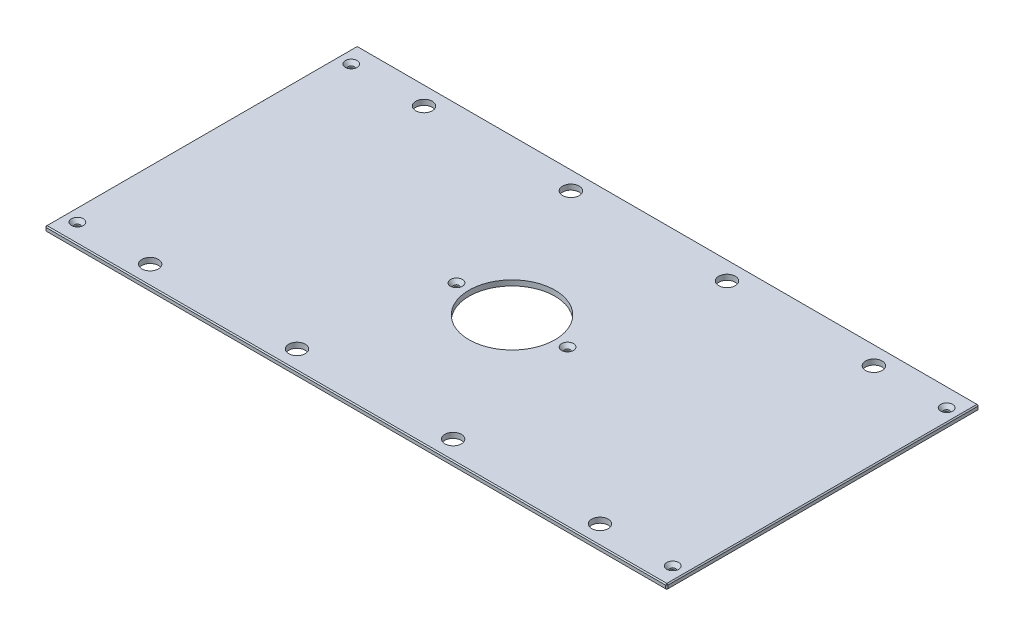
ISO-10303-21;
HEADER;
FILE_DESCRIPTION(('STEP AP214'),'2;1');
FILE_NAME('part.step','',(''),(''),'','','');
FILE_SCHEMA(('AUTOMOTIVE_DESIGN { 1 0 10303 214 1 1 1 1 }'));
ENDSEC;
DATA;
#1=APPLICATION_CONTEXT('core data for automotive mechanical design processes');
#2=APPLICATION_PROTOCOL_DEFINITION('international standard','automotive_design',2000,#1);
#3=PRODUCT_CONTEXT('',#1,'mechanical');
#4=PRODUCT('Part','Part','',(#3));
#5=PRODUCT_RELATED_PRODUCT_CATEGORY('part','',(#4));
#6=PRODUCT_DEFINITION_FORMATION('','',#4);
#7=PRODUCT_DEFINITION_CONTEXT('part definition',#1,'design');
#8=PRODUCT_DEFINITION('design','',#6,#7);
#9=PRODUCT_DEFINITION_SHAPE('','',#8);
#10=(LENGTH_UNIT() NAMED_UNIT(*) SI_UNIT(.MILLI.,.METRE.));
#11=(NAMED_UNIT(*) PLANE_ANGLE_UNIT() SI_UNIT($,.RADIAN.));
#12=(NAMED_UNIT(*) SI_UNIT($,.STERADIAN.) SOLID_ANGLE_UNIT());
#13=UNCERTAINTY_MEASURE_WITH_UNIT(LENGTH_MEASURE(1.E-05),#10,'distance_accuracy_value','');
#14=(GEOMETRIC_REPRESENTATION_CONTEXT(3) GLOBAL_UNCERTAINTY_ASSIGNED_CONTEXT((#13)) GLOBAL_UNIT_ASSIGNED_CONTEXT((#10,
#11,#12)) REPRESENTATION_CONTEXT('',''));
#15=CARTESIAN_POINT('',(0.,0.,0.));
#16=DIRECTION('',(0.,0.,1.));
#17=DIRECTION('',(1.,0.,0.));
#18=AXIS2_PLACEMENT_3D('',#15,#16,#17);
#19=CARTESIAN_POINT('',(-373.0625,6.35,-187.325));
#20=DIRECTION('',(1.,0.,0.));
#21=DIRECTION('',(0.,0.,-1.));
#22=AXIS2_PLACEMENT_3D('',#19,#20,#21);
#23=PLANE('',#22);
#24=DIRECTION('',(0.,0.,-1.));
#25=VECTOR('',#24,1.);
#26=CARTESIAN_POINT('',(-373.0625,5.0799999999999,-187.325));
#27=LINE('',#26,#25);
#28=CARTESIAN_POINT('',(-373.0625,5.0799999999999,186.055));
#29=VERTEX_POINT('',#28);
#30=CARTESIAN_POINT('',(-373.0625,5.0799999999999,-186.055));
#31=VERTEX_POINT('',#30);
#32=EDGE_CURVE('E135',#29,#31,#27,.T.);
#33=ORIENTED_EDGE('',*,*,#32,.T.);
#34=DIRECTION('',(0.,-1.,0.));
#35=VECTOR('',#34,1.);
#36=CARTESIAN_POINT('',(-373.0625,6.35,-186.055));
#37=LINE('',#36,#35);
#38=CARTESIAN_POINT('',(-373.0625,1.2700000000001,-186.055));
#39=VERTEX_POINT('',#38);
#40=EDGE_CURVE('E131',#31,#39,#37,.T.);
#41=ORIENTED_EDGE('',*,*,#40,.T.);
#42=DIRECTION('',(0.,0.,1.));
#43=VECTOR('',#42,1.);
#44=CARTESIAN_POINT('',(-373.0625,1.2700000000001,-187.325));
#45=LINE('',#44,#43);
#46=CARTESIAN_POINT('',(-373.0625,1.2700000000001,186.055));
#47=VERTEX_POINT('',#46);
#48=EDGE_CURVE('E126',#39,#47,#45,.T.);
#49=ORIENTED_EDGE('',*,*,#48,.T.);
#50=DIRECTION('',(0.,1.,0.));
#51=VECTOR('',#50,1.);
#52=CARTESIAN_POINT('',(-373.0625,6.35,186.055));
#53=LINE('',#52,#51);
#54=EDGE_CURVE('E128',#47,#29,#53,.T.);
#55=ORIENTED_EDGE('',*,*,#54,.T.);
#56=EDGE_LOOP('',(#33,#41,#49,#55));
#57=FACE_BOUND('',#56,.T.);
#58=ADVANCED_FACE('F35',(#57),#23,.F.);
#59=CARTESIAN_POINT('',(-373.0625,6.35,187.325));
#60=DIRECTION('',(0.,0.,-1.));
#61=DIRECTION('',(-1.,0.,0.));
#62=AXIS2_PLACEMENT_3D('',#59,#60,#61);
#63=PLANE('',#62);
#64=DIRECTION('',(1.,0.,0.));
#65=VECTOR('',#64,1.);
#66=CARTESIAN_POINT('',(-373.0625,1.2700000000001,187.325));
#67=LINE('',#66,#65);
#68=CARTESIAN_POINT('',(-371.7925,1.2700000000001,187.325));
#69=VERTEX_POINT('',#68);
#70=CARTESIAN_POINT('',(371.7925,1.2700000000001,187.325));
#71=VERTEX_POINT('',#70);
#72=EDGE_CURVE('E58',#69,#71,#67,.T.);
#73=ORIENTED_EDGE('',*,*,#72,.T.);
#74=DIRECTION('',(0.,1.,0.));
#75=VECTOR('',#74,1.);
#76=CARTESIAN_POINT('',(371.7925,6.35,187.325));
#77=LINE('',#76,#75);
#78=CARTESIAN_POINT('',(371.7925,5.0799999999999,187.325));
#79=VERTEX_POINT('',#78);
#80=EDGE_CURVE('E11',#71,#79,#77,.T.);
#81=ORIENTED_EDGE('',*,*,#80,.T.);
#82=DIRECTION('',(-1.,0.,0.));
#83=VECTOR('',#82,1.);
#84=CARTESIAN_POINT('',(-373.0625,5.0799999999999,187.325));
#85=LINE('',#84,#83);
#86=CARTESIAN_POINT('',(-371.7925,5.0799999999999,187.325));
#87=VERTEX_POINT('',#86);
#88=EDGE_CURVE('E44',#79,#87,#85,.T.);
#89=ORIENTED_EDGE('',*,*,#88,.T.);
#90=DIRECTION('',(0.,-1.,0.));
#91=VECTOR('',#90,1.);
#92=CARTESIAN_POINT('',(-371.7925,6.35,187.325));
#93=LINE('',#92,#91);
#94=EDGE_CURVE('E303',#87,#69,#93,.T.);
#95=ORIENTED_EDGE('',*,*,#94,.T.);
#96=EDGE_LOOP('',(#73,#81,#89,#95));
#97=FACE_BOUND('',#96,.T.);
#98=ADVANCED_FACE('F372',(#97),#63,.F.);
#99=CARTESIAN_POINT('',(373.0625,6.35,-187.325));
#100=DIRECTION('',(-1.,0.,0.));
#101=DIRECTION('',(0.,0.,1.));
#102=AXIS2_PLACEMENT_3D('',#99,#100,#101);
#103=PLANE('',#102);
#104=DIRECTION('',(0.,0.,-1.));
#105=VECTOR('',#104,1.);
#106=CARTESIAN_POINT('',(373.0625,1.2700000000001,-187.325));
#107=LINE('',#106,#105);
#108=CARTESIAN_POINT('',(373.0625,1.2700000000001,186.055));
#109=VERTEX_POINT('',#108);
#110=CARTESIAN_POINT('',(373.0625,1.2700000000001,-186.055));
#111=VERTEX_POINT('',#110);
#112=EDGE_CURVE('E298',#109,#111,#107,.T.);
#113=ORIENTED_EDGE('',*,*,#112,.T.);
#114=DIRECTION('',(0.,1.,0.));
#115=VECTOR('',#114,1.);
#116=CARTESIAN_POINT('',(373.0625,6.35,-186.055));
#117=LINE('',#116,#115);
#118=CARTESIAN_POINT('',(373.0625,5.0799999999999,-186.055));
#119=VERTEX_POINT('',#118);
#120=EDGE_CURVE('E300',#111,#119,#117,.T.);
#121=ORIENTED_EDGE('',*,*,#120,.T.);
#122=DIRECTION('',(0.,0.,1.));
#123=VECTOR('',#122,1.);
#124=CARTESIAN_POINT('',(373.0625,5.0799999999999,187.325));
#125=LINE('',#124,#123);
#126=CARTESIAN_POINT('',(373.0625,5.0799999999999,186.055));
#127=VERTEX_POINT('',#126);
#128=EDGE_CURVE('E296',#119,#127,#125,.T.);
#129=ORIENTED_EDGE('',*,*,#128,.T.);
#130=DIRECTION('',(0.,-1.,0.));
#131=VECTOR('',#130,1.);
#132=CARTESIAN_POINT('',(373.0625,6.35,186.055));
#133=LINE('',#132,#131);
#134=EDGE_CURVE('E294',#127,#109,#133,.T.);
#135=ORIENTED_EDGE('',*,*,#134,.T.);
#136=EDGE_LOOP('',(#113,#121,#129,#135));
#137=FACE_BOUND('',#136,.T.);
#138=ADVANCED_FACE('F359',(#137),#103,.F.);
#139=CARTESIAN_POINT('',(-373.0625,6.35,-187.325));
#140=DIRECTION('',(0.,0.,1.));
#141=DIRECTION('',(1.,0.,0.));
#142=AXIS2_PLACEMENT_3D('',#139,#140,#141);
#143=PLANE('',#142);
#144=DIRECTION('',(-1.,0.,0.));
#145=VECTOR('',#144,1.);
#146=CARTESIAN_POINT('',(-373.0625,1.2700000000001,-187.325));
#147=LINE('',#146,#145);
#148=CARTESIAN_POINT('',(371.7925,1.2700000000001,-187.325));
#149=VERTEX_POINT('',#148);
#150=CARTESIAN_POINT('',(-371.7925,1.2700000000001,-187.325));
#151=VERTEX_POINT('',#150);
#152=EDGE_CURVE('E270',#149,#151,#147,.T.);
#153=ORIENTED_EDGE('',*,*,#152,.T.);
#154=DIRECTION('',(0.,1.,0.));
#155=VECTOR('',#154,1.);
#156=CARTESIAN_POINT('',(-371.7925,6.35,-187.325));
#157=LINE('',#156,#155);
#158=CARTESIAN_POINT('',(-371.7925,5.0799999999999,-187.325));
#159=VERTEX_POINT('',#158);
#160=EDGE_CURVE('E274',#151,#159,#157,.T.);
#161=ORIENTED_EDGE('',*,*,#160,.T.);
#162=DIRECTION('',(1.,0.,0.));
#163=VECTOR('',#162,1.);
#164=CARTESIAN_POINT('',(373.0625,5.0799999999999,-187.325));
#165=LINE('',#164,#163);
#166=CARTESIAN_POINT('',(371.7925,5.0799999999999,-187.325));
#167=VERTEX_POINT('',#166);
#168=EDGE_CURVE('E272',#159,#167,#165,.T.);
#169=ORIENTED_EDGE('',*,*,#168,.T.);
#170=DIRECTION('',(0.,-1.,0.));
#171=VECTOR('',#170,1.);
#172=CARTESIAN_POINT('',(371.7925,6.35,-187.325));
#173=LINE('',#172,#171);
#174=EDGE_CURVE('E268',#167,#149,#173,.T.);
#175=ORIENTED_EDGE('',*,*,#174,.T.);
#176=EDGE_LOOP('',(#153,#161,#169,#175));
#177=FACE_BOUND('',#176,.T.);
#178=ADVANCED_FACE('F333',(#177),#143,.F.);
#179=CARTESIAN_POINT('',(0.,6.35,0.));
#180=DIRECTION('',(0.,1.,0.));
#181=DIRECTION('',(0.,0.,1.));
#182=AXIS2_PLACEMENT_3D('',#179,#180,#181);
#183=PLANE('',#182);
#184=CARTESIAN_POINT('',(357.1875,6.35,-164.30498));
#185=DIRECTION('',(0.,1.,0.));
#186=DIRECTION('',(0.,0.,1.));
#187=AXIS2_PLACEMENT_3D('',#184,#185,#186);
#188=CIRCLE('',#187,7.13740000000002);
#189=CARTESIAN_POINT('',(357.1875,6.35,-157.16758));
#190=VERTEX_POINT('',#189);
#191=EDGE_CURVE('E816',#190,#190,#188,.T.);
#192=ORIENTED_EDGE('',*,*,#191,.F.);
#193=EDGE_LOOP('',(#192));
#194=FACE_BOUND('',#193,.T.);
#195=CARTESIAN_POINT('',(357.1875,6.35,164.30498));
#196=DIRECTION('',(0.,1.,0.));
#197=DIRECTION('',(0.,0.,1.));
#198=AXIS2_PLACEMENT_3D('',#195,#196,#197);
#199=CIRCLE('',#198,7.13740000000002);
#200=CARTESIAN_POINT('',(357.1875,6.35,171.44238));
#201=VERTEX_POINT('',#200);
#202=EDGE_CURVE('E820',#201,#201,#199,.T.);
#203=ORIENTED_EDGE('',*,*,#202,.F.);
#204=EDGE_LOOP('',(#203));
#205=FACE_BOUND('',#204,.T.);
#206=CARTESIAN_POINT('',(-357.1875,6.35,164.30498));
#207=DIRECTION('',(0.,1.,0.));
#208=DIRECTION('',(0.,0.,1.));
#209=AXIS2_PLACEMENT_3D('',#206,#207,#208);
#210=CIRCLE('',#209,7.13740000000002);
#211=CARTESIAN_POINT('',(-357.1875,6.35,171.44238));
#212=VERTEX_POINT('',#211);
#213=EDGE_CURVE('E824',#212,#212,#210,.T.);
#214=ORIENTED_EDGE('',*,*,#213,.F.);
#215=EDGE_LOOP('',(#214));
#216=FACE_BOUND('',#215,.T.);
#217=CARTESIAN_POINT('',(-66.675,6.35,0.));
#218=DIRECTION('',(0.,1.,0.));
#219=DIRECTION('',(0.,0.,1.));
#220=AXIS2_PLACEMENT_3D('',#217,#218,#219);
#221=CIRCLE('',#220,7.1374);
#222=CARTESIAN_POINT('',(-66.675,6.35,7.1374));
#223=VERTEX_POINT('',#222);
#224=EDGE_CURVE('E828',#223,#223,#221,.T.);
#225=ORIENTED_EDGE('',*,*,#224,.F.);
#226=EDGE_LOOP('',(#225));
#227=FACE_BOUND('',#226,.T.);
#228=CARTESIAN_POINT('',(66.675,6.35,0.));
#229=DIRECTION('',(0.,1.,0.));
#230=DIRECTION('',(0.,0.,1.));
#231=AXIS2_PLACEMENT_3D('',#228,#229,#230);
#232=CIRCLE('',#231,7.1374);
#233=CARTESIAN_POINT('',(66.675,6.35,7.1374));
#234=VERTEX_POINT('',#233);
#235=EDGE_CURVE('E832',#234,#234,#232,.T.);
#236=ORIENTED_EDGE('',*,*,#235,.F.);
#237=EDGE_LOOP('',(#236));
#238=FACE_BOUND('',#237,.T.);
#239=CARTESIAN_POINT('',(-357.1875,6.35,-164.30498));
#240=DIRECTION('',(0.,1.,0.));
#241=DIRECTION('',(0.,0.,1.));
#242=AXIS2_PLACEMENT_3D('',#239,#240,#241);
#243=CIRCLE('',#242,7.13740000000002);
#244=CARTESIAN_POINT('',(-357.1875,6.35,-157.16758));
#245=VERTEX_POINT('',#244);
#246=EDGE_CURVE('E835',#245,#245,#243,.T.);
#247=ORIENTED_EDGE('',*,*,#246,.F.);
#248=EDGE_LOOP('',(#247));
#249=FACE_BOUND('',#248,.T.);
#250=DIRECTION('',(0.,0.,-1.));
#251=VECTOR('',#250,1.);
#252=CARTESIAN_POINT('',(371.7925,6.35,-187.325));
#253=LINE('',#252,#251);
#254=CARTESIAN_POINT('',(371.7925,6.35,186.055));
#255=VERTEX_POINT('',#254);
#256=CARTESIAN_POINT('',(371.7925,6.35,-186.055));
#257=VERTEX_POINT('',#256);
#258=EDGE_CURVE('E281',#255,#257,#253,.T.);
#259=ORIENTED_EDGE('',*,*,#258,.T.);
#260=DIRECTION('',(-1.,0.,0.));
#261=VECTOR('',#260,1.);
#262=CARTESIAN_POINT('',(-373.0625,6.35,-186.055));
#263=LINE('',#262,#261);
#264=CARTESIAN_POINT('',(-371.7925,6.35,-186.055));
#265=VERTEX_POINT('',#264);
#266=EDGE_CURVE('E283',#257,#265,#263,.T.);
#267=ORIENTED_EDGE('',*,*,#266,.T.);
#268=DIRECTION('',(0.,0.,1.));
#269=VECTOR('',#268,1.);
#270=CARTESIAN_POINT('',(-371.7925,6.35,187.325));
#271=LINE('',#270,#269);
#272=CARTESIAN_POINT('',(-371.7925,6.35,186.055));
#273=VERTEX_POINT('',#272);
#274=EDGE_CURVE('E279',#265,#273,#271,.T.);
#275=ORIENTED_EDGE('',*,*,#274,.T.);
#276=DIRECTION('',(1.,0.,0.));
#277=VECTOR('',#276,1.);
#278=CARTESIAN_POINT('',(373.0625,6.35,186.055));
#279=LINE('',#278,#277);
#280=EDGE_CURVE('E277',#273,#255,#279,.T.);
#281=ORIENTED_EDGE('',*,*,#280,.T.);
#282=EDGE_LOOP('',(#259,#267,#275,#281));
#283=FACE_BOUND('',#282,.T.);
#284=CARTESIAN_POINT('',(269.875,6.35,-164.30498));
#285=DIRECTION('',(0.,1.,0.));
#286=DIRECTION('',(0.,0.,1.));
#287=AXIS2_PLACEMENT_3D('',#284,#285,#286);
#288=CIRCLE('',#287,9.92187500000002);
#289=CARTESIAN_POINT('',(269.875,6.35,-154.383105));
#290=VERTEX_POINT('',#289);
#291=EDGE_CURVE('E204',#290,#290,#288,.T.);
#292=ORIENTED_EDGE('',*,*,#291,.F.);
#293=EDGE_LOOP('',(#292));
#294=FACE_BOUND('',#293,.T.);
#295=CARTESIAN_POINT('',(-269.875,6.35,-164.30498));
#296=DIRECTION('',(0.,1.,0.));
#297=DIRECTION('',(0.,0.,1.));
#298=AXIS2_PLACEMENT_3D('',#295,#296,#297);
#299=CIRCLE('',#298,9.92187500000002);
#300=CARTESIAN_POINT('',(-269.875,6.35,-154.383105));
#301=VERTEX_POINT('',#300);
#302=EDGE_CURVE('E214',#301,#301,#299,.T.);
#303=ORIENTED_EDGE('',*,*,#302,.F.);
#304=EDGE_LOOP('',(#303));
#305=FACE_BOUND('',#304,.T.);
#306=CARTESIAN_POINT('',(269.875,6.35,164.30498));
#307=DIRECTION('',(0.,1.,0.));
#308=DIRECTION('',(0.,0.,1.));
#309=AXIS2_PLACEMENT_3D('',#306,#307,#308);
#310=CIRCLE('',#309,9.92187500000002);
#311=CARTESIAN_POINT('',(269.875,6.35,174.226855));
#312=VERTEX_POINT('',#311);
#313=EDGE_CURVE('E225',#312,#312,#310,.T.);
#314=ORIENTED_EDGE('',*,*,#313,.F.);
#315=EDGE_LOOP('',(#314));
#316=FACE_BOUND('',#315,.T.);
#317=CARTESIAN_POINT('',(-269.875,6.35,164.30498));
#318=DIRECTION('',(0.,1.,0.));
#319=DIRECTION('',(0.,0.,1.));
#320=AXIS2_PLACEMENT_3D('',#317,#318,#319);
#321=CIRCLE('',#320,9.92187500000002);
#322=CARTESIAN_POINT('',(-269.875,6.35,174.226855));
#323=VERTEX_POINT('',#322);
#324=EDGE_CURVE('E231',#323,#323,#321,.T.);
#325=ORIENTED_EDGE('',*,*,#324,.F.);
#326=EDGE_LOOP('',(#325));
#327=FACE_BOUND('',#326,.T.);
#328=CARTESIAN_POINT('',(-93.6625,6.35,-164.30498));
#329=DIRECTION('',(0.,1.,0.));
#330=DIRECTION('',(0.,0.,1.));
#331=AXIS2_PLACEMENT_3D('',#328,#329,#330);
#332=CIRCLE('',#331,9.921875);
#333=CARTESIAN_POINT('',(-93.6625,6.35,-154.383105));
#334=VERTEX_POINT('',#333);
#335=EDGE_CURVE('E237',#334,#334,#332,.T.);
#336=ORIENTED_EDGE('',*,*,#335,.F.);
#337=EDGE_LOOP('',(#336));
#338=FACE_BOUND('',#337,.T.);
#339=CARTESIAN_POINT('',(93.6625,6.35,-164.30498));
#340=DIRECTION('',(0.,1.,0.));
#341=DIRECTION('',(0.,0.,1.));
#342=AXIS2_PLACEMENT_3D('',#339,#340,#341);
#343=CIRCLE('',#342,9.921875);
#344=CARTESIAN_POINT('',(93.6625,6.35,-154.383105));
#345=VERTEX_POINT('',#344);
#346=EDGE_CURVE('E243',#345,#345,#343,.T.);
#347=ORIENTED_EDGE('',*,*,#346,.F.);
#348=EDGE_LOOP('',(#347));
#349=FACE_BOUND('',#348,.T.);
#350=CARTESIAN_POINT('',(93.6625,6.35,164.30498));
#351=DIRECTION('',(0.,1.,0.));
#352=DIRECTION('',(0.,0.,1.));
#353=AXIS2_PLACEMENT_3D('',#350,#351,#352);
#354=CIRCLE('',#353,9.921875);
#355=CARTESIAN_POINT('',(93.6625,6.35,174.226855));
#356=VERTEX_POINT('',#355);
#357=EDGE_CURVE('E249',#356,#356,#354,.T.);
#358=ORIENTED_EDGE('',*,*,#357,.F.);
#359=EDGE_LOOP('',(#358));
#360=FACE_BOUND('',#359,.T.);
#361=CARTESIAN_POINT('',(-93.6625,6.35,164.30498));
#362=DIRECTION('',(0.,1.,0.));
#363=DIRECTION('',(0.,0.,1.));
#364=AXIS2_PLACEMENT_3D('',#361,#362,#363);
#365=CIRCLE('',#364,9.921875);
#366=CARTESIAN_POINT('',(-93.6625,6.35,174.226855));
#367=VERTEX_POINT('',#366);
#368=EDGE_CURVE('E255',#367,#367,#365,.T.);
#369=ORIENTED_EDGE('',*,*,#368,.F.);
#370=EDGE_LOOP('',(#369));
#371=FACE_BOUND('',#370,.T.);
#372=CARTESIAN_POINT('',(0.,6.35,0.));
#373=DIRECTION('',(0.,1.,0.));
#374=DIRECTION('',(0.,0.,1.));
#375=AXIS2_PLACEMENT_3D('',#372,#373,#374);
#376=CIRCLE('',#375,51.562);
#377=CARTESIAN_POINT('',(0.,6.35,51.562));
#378=VERTEX_POINT('',#377);
#379=EDGE_CURVE('E261',#378,#378,#376,.T.);
#380=ORIENTED_EDGE('',*,*,#379,.F.);
#381=EDGE_LOOP('',(#380));
#382=FACE_BOUND('',#381,.T.);
#383=ADVANCED_FACE('F381',(#194,#205,#216,#227,#238,#249,#283,#294,#305,#316,#327,#338,#349,
#360,#371,#382),#183,.T.);
#384=CARTESIAN_POINT('',(0.,0.,0.));
#385=DIRECTION('',(0.,1.,0.));
#386=DIRECTION('',(0.,0.,1.));
#387=AXIS2_PLACEMENT_3D('',#384,#385,#386);
#388=PLANE('',#387);
#389=CARTESIAN_POINT('',(357.1875,0.,-164.30498));
#390=DIRECTION('',(0.,1.,0.));
#391=DIRECTION('',(0.,0.,1.));
#392=AXIS2_PLACEMENT_3D('',#389,#390,#391);
#393=CIRCLE('',#392,3.3782);
#394=CARTESIAN_POINT('',(357.1875,0.,-160.92678));
#395=VERTEX_POINT('',#394);
#396=EDGE_CURVE('E869',#395,#395,#393,.T.);
#397=ORIENTED_EDGE('',*,*,#396,.T.);
#398=EDGE_LOOP('',(#397));
#399=FACE_BOUND('',#398,.T.);
#400=CARTESIAN_POINT('',(357.1875,0.,164.30498));
#401=DIRECTION('',(0.,1.,0.));
#402=DIRECTION('',(0.,0.,1.));
#403=AXIS2_PLACEMENT_3D('',#400,#401,#402);
#404=CIRCLE('',#403,3.3782);
#405=CARTESIAN_POINT('',(357.1875,0.,167.68318));
#406=VERTEX_POINT('',#405);
#407=EDGE_CURVE('E862',#406,#406,#404,.T.);
#408=ORIENTED_EDGE('',*,*,#407,.T.);
#409=EDGE_LOOP('',(#408));
#410=FACE_BOUND('',#409,.T.);
#411=CARTESIAN_POINT('',(-357.1875,0.,164.30498));
#412=DIRECTION('',(0.,1.,0.));
#413=DIRECTION('',(0.,0.,1.));
#414=AXIS2_PLACEMENT_3D('',#411,#412,#413);
#415=CIRCLE('',#414,3.3782);
#416=CARTESIAN_POINT('',(-357.1875,0.,167.68318));
#417=VERTEX_POINT('',#416);
#418=EDGE_CURVE('E855',#417,#417,#415,.T.);
#419=ORIENTED_EDGE('',*,*,#418,.T.);
#420=EDGE_LOOP('',(#419));
#421=FACE_BOUND('',#420,.T.);
#422=CARTESIAN_POINT('',(-66.675,0.,0.));
#423=DIRECTION('',(0.,1.,0.));
#424=DIRECTION('',(0.,0.,1.));
#425=AXIS2_PLACEMENT_3D('',#422,#423,#424);
#426=CIRCLE('',#425,3.3782);
#427=CARTESIAN_POINT('',(-66.675,0.,3.3782));
#428=VERTEX_POINT('',#427);
#429=EDGE_CURVE('E848',#428,#428,#426,.T.);
#430=ORIENTED_EDGE('',*,*,#429,.T.);
#431=EDGE_LOOP('',(#430));
#432=FACE_BOUND('',#431,.T.);
#433=CARTESIAN_POINT('',(66.675,0.,0.));
#434=DIRECTION('',(0.,1.,0.));
#435=DIRECTION('',(0.,0.,1.));
#436=AXIS2_PLACEMENT_3D('',#433,#434,#435);
#437=CIRCLE('',#436,3.3782);
#438=CARTESIAN_POINT('',(66.675,0.,3.3782));
#439=VERTEX_POINT('',#438);
#440=EDGE_CURVE('E838',#439,#439,#437,.T.);
#441=ORIENTED_EDGE('',*,*,#440,.T.);
#442=EDGE_LOOP('',(#441));
#443=FACE_BOUND('',#442,.T.);
#444=CARTESIAN_POINT('',(-357.1875,0.,-164.30498));
#445=DIRECTION('',(0.,1.,0.));
#446=DIRECTION('',(0.,0.,1.));
#447=AXIS2_PLACEMENT_3D('',#444,#445,#446);
#448=CIRCLE('',#447,3.3782);
#449=CARTESIAN_POINT('',(-357.1875,0.,-160.92678));
#450=VERTEX_POINT('',#449);
#451=EDGE_CURVE('E217',#450,#450,#448,.T.);
#452=ORIENTED_EDGE('',*,*,#451,.T.);
#453=EDGE_LOOP('',(#452));
#454=FACE_BOUND('',#453,.T.);
#455=DIRECTION('',(0.,0.,-1.));
#456=VECTOR('',#455,1.);
#457=CARTESIAN_POINT('',(-371.7925,0.,0.));
#458=LINE('',#457,#456);
#459=CARTESIAN_POINT('',(-371.7925,0.,186.055));
#460=VERTEX_POINT('',#459);
#461=CARTESIAN_POINT('',(-371.7925,0.,-186.055));
#462=VERTEX_POINT('',#461);
#463=EDGE_CURVE('E158',#460,#462,#458,.T.);
#464=ORIENTED_EDGE('',*,*,#463,.T.);
#465=DIRECTION('',(1.,0.,0.));
#466=VECTOR('',#465,1.);
#467=CARTESIAN_POINT('',(0.,0.,-186.055));
#468=LINE('',#467,#466);
#469=CARTESIAN_POINT('',(371.7925,0.,-186.055));
#470=VERTEX_POINT('',#469);
#471=EDGE_CURVE('E291',#462,#470,#468,.T.);
#472=ORIENTED_EDGE('',*,*,#471,.T.);
#473=DIRECTION('',(0.,0.,1.));
#474=VECTOR('',#473,1.);
#475=CARTESIAN_POINT('',(371.7925,0.,0.));
#476=LINE('',#475,#474);
#477=CARTESIAN_POINT('',(371.7925,0.,186.055));
#478=VERTEX_POINT('',#477);
#479=EDGE_CURVE('E289',#470,#478,#476,.T.);
#480=ORIENTED_EDGE('',*,*,#479,.T.);
#481=DIRECTION('',(-1.,0.,0.));
#482=VECTOR('',#481,1.);
#483=CARTESIAN_POINT('',(0.,0.,186.055));
#484=LINE('',#483,#482);
#485=EDGE_CURVE('E286',#478,#460,#484,.T.);
#486=ORIENTED_EDGE('',*,*,#485,.T.);
#487=EDGE_LOOP('',(#464,#472,#480,#486));
#488=FACE_BOUND('',#487,.T.);
#489=CARTESIAN_POINT('',(269.875,0.,-164.30498));
#490=DIRECTION('',(0.,1.,0.));
#491=DIRECTION('',(0.,0.,1.));
#492=AXIS2_PLACEMENT_3D('',#489,#490,#491);
#493=CIRCLE('',#492,9.92187500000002);
#494=CARTESIAN_POINT('',(269.875,0.,-154.383105));
#495=VERTEX_POINT('',#494);
#496=EDGE_CURVE('E209',#495,#495,#493,.T.);
#497=ORIENTED_EDGE('',*,*,#496,.T.);
#498=EDGE_LOOP('',(#497));
#499=FACE_BOUND('',#498,.T.);
#500=CARTESIAN_POINT('',(-269.875,0.,-164.30498));
#501=DIRECTION('',(0.,1.,0.));
#502=DIRECTION('',(0.,0.,1.));
#503=AXIS2_PLACEMENT_3D('',#500,#501,#502);
#504=CIRCLE('',#503,9.92187500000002);
#505=CARTESIAN_POINT('',(-269.875,0.,-154.383105));
#506=VERTEX_POINT('',#505);
#507=EDGE_CURVE('E222',#506,#506,#504,.T.);
#508=ORIENTED_EDGE('',*,*,#507,.T.);
#509=EDGE_LOOP('',(#508));
#510=FACE_BOUND('',#509,.T.);
#511=CARTESIAN_POINT('',(269.875,0.,164.30498));
#512=DIRECTION('',(0.,1.,0.));
#513=DIRECTION('',(0.,0.,1.));
#514=AXIS2_PLACEMENT_3D('',#511,#512,#513);
#515=CIRCLE('',#514,9.92187500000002);
#516=CARTESIAN_POINT('',(269.875,0.,174.226855));
#517=VERTEX_POINT('',#516);
#518=EDGE_CURVE('E228',#517,#517,#515,.T.);
#519=ORIENTED_EDGE('',*,*,#518,.T.);
#520=EDGE_LOOP('',(#519));
#521=FACE_BOUND('',#520,.T.);
#522=CARTESIAN_POINT('',(-269.875,0.,164.30498));
#523=DIRECTION('',(0.,1.,0.));
#524=DIRECTION('',(0.,0.,1.));
#525=AXIS2_PLACEMENT_3D('',#522,#523,#524);
#526=CIRCLE('',#525,9.92187500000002);
#527=CARTESIAN_POINT('',(-269.875,0.,174.226855));
#528=VERTEX_POINT('',#527);
#529=EDGE_CURVE('E234',#528,#528,#526,.T.);
#530=ORIENTED_EDGE('',*,*,#529,.T.);
#531=EDGE_LOOP('',(#530));
#532=FACE_BOUND('',#531,.T.);
#533=CARTESIAN_POINT('',(-93.6625,0.,-164.30498));
#534=DIRECTION('',(0.,1.,0.));
#535=DIRECTION('',(0.,0.,1.));
#536=AXIS2_PLACEMENT_3D('',#533,#534,#535);
#537=CIRCLE('',#536,9.921875);
#538=CARTESIAN_POINT('',(-93.6625,0.,-154.383105));
#539=VERTEX_POINT('',#538);
#540=EDGE_CURVE('E240',#539,#539,#537,.T.);
#541=ORIENTED_EDGE('',*,*,#540,.T.);
#542=EDGE_LOOP('',(#541));
#543=FACE_BOUND('',#542,.T.);
#544=CARTESIAN_POINT('',(93.6625,0.,-164.30498));
#545=DIRECTION('',(0.,1.,0.));
#546=DIRECTION('',(0.,0.,1.));
#547=AXIS2_PLACEMENT_3D('',#544,#545,#546);
#548=CIRCLE('',#547,9.921875);
#549=CARTESIAN_POINT('',(93.6625,0.,-154.383105));
#550=VERTEX_POINT('',#549);
#551=EDGE_CURVE('E246',#550,#550,#548,.T.);
#552=ORIENTED_EDGE('',*,*,#551,.T.);
#553=EDGE_LOOP('',(#552));
#554=FACE_BOUND('',#553,.T.);
#555=CARTESIAN_POINT('',(93.6625,0.,164.30498));
#556=DIRECTION('',(0.,1.,0.));
#557=DIRECTION('',(0.,0.,1.));
#558=AXIS2_PLACEMENT_3D('',#555,#556,#557);
#559=CIRCLE('',#558,9.921875);
#560=CARTESIAN_POINT('',(93.6625,0.,174.226855));
#561=VERTEX_POINT('',#560);
#562=EDGE_CURVE('E252',#561,#561,#559,.T.);
#563=ORIENTED_EDGE('',*,*,#562,.T.);
#564=EDGE_LOOP('',(#563));
#565=FACE_BOUND('',#564,.T.);
#566=CARTESIAN_POINT('',(-93.6625,0.,164.30498));
#567=DIRECTION('',(0.,1.,0.));
#568=DIRECTION('',(0.,0.,1.));
#569=AXIS2_PLACEMENT_3D('',#566,#567,#568);
#570=CIRCLE('',#569,9.921875);
#571=CARTESIAN_POINT('',(-93.6625,0.,174.226855));
#572=VERTEX_POINT('',#571);
#573=EDGE_CURVE('E258',#572,#572,#570,.T.);
#574=ORIENTED_EDGE('',*,*,#573,.T.);
#575=EDGE_LOOP('',(#574));
#576=FACE_BOUND('',#575,.T.);
#577=CARTESIAN_POINT('',(0.,0.,0.));
#578=DIRECTION('',(0.,1.,0.));
#579=DIRECTION('',(0.,0.,1.));
#580=AXIS2_PLACEMENT_3D('',#577,#578,#579);
#581=CIRCLE('',#580,51.562);
#582=CARTESIAN_POINT('',(0.,0.,51.562));
#583=VERTEX_POINT('',#582);
#584=EDGE_CURVE('E147',#583,#583,#581,.T.);
#585=ORIENTED_EDGE('',*,*,#584,.T.);
#586=EDGE_LOOP('',(#585));
#587=FACE_BOUND('',#586,.T.);
#588=ADVANCED_FACE('F346',(#399,#410,#421,#432,#443,#454,#488,#499,#510,#521,#532,#543,#554,
#565,#576,#587),#388,.F.);
#589=CARTESIAN_POINT('',(0.,0.,0.));
#590=DIRECTION('',(0.,1.,0.));
#591=DIRECTION('',(0.,0.,1.));
#592=AXIS2_PLACEMENT_3D('',#589,#590,#591);
#593=CYLINDRICAL_SURFACE('',#592,51.562);
#594=ORIENTED_EDGE('',*,*,#584,.F.);
#595=EDGE_LOOP('',(#594));
#596=FACE_BOUND('',#595,.T.);
#597=ORIENTED_EDGE('',*,*,#379,.T.);
#598=EDGE_LOOP('',(#597));
#599=FACE_BOUND('',#598,.T.);
#600=ADVANCED_FACE('F751',(#596,#599),#593,.F.);
#601=CARTESIAN_POINT('',(-93.6625,6.35,164.30498));
#602=DIRECTION('',(0.,1.,0.));
#603=DIRECTION('',(0.,0.,1.));
#604=AXIS2_PLACEMENT_3D('',#601,#602,#603);
#605=CYLINDRICAL_SURFACE('',#604,9.921875);
#606=ORIENTED_EDGE('',*,*,#573,.F.);
#607=EDGE_LOOP('',(#606));
#608=FACE_BOUND('',#607,.T.);
#609=ORIENTED_EDGE('',*,*,#368,.T.);
#610=EDGE_LOOP('',(#609));
#611=FACE_BOUND('',#610,.T.);
#612=ADVANCED_FACE('F742',(#608,#611),#605,.F.);
#613=CARTESIAN_POINT('',(93.6625,6.35,164.30498));
#614=DIRECTION('',(0.,1.,0.));
#615=DIRECTION('',(0.,0.,1.));
#616=AXIS2_PLACEMENT_3D('',#613,#614,#615);
#617=CYLINDRICAL_SURFACE('',#616,9.921875);
#618=ORIENTED_EDGE('',*,*,#562,.F.);
#619=EDGE_LOOP('',(#618));
#620=FACE_BOUND('',#619,.T.);
#621=ORIENTED_EDGE('',*,*,#357,.T.);
#622=EDGE_LOOP('',(#621));
#623=FACE_BOUND('',#622,.T.);
#624=ADVANCED_FACE('F733',(#620,#623),#617,.F.);
#625=CARTESIAN_POINT('',(93.6625,6.35,-164.30498));
#626=DIRECTION('',(0.,1.,0.));
#627=DIRECTION('',(0.,0.,1.));
#628=AXIS2_PLACEMENT_3D('',#625,#626,#627);
#629=CYLINDRICAL_SURFACE('',#628,9.921875);
#630=ORIENTED_EDGE('',*,*,#551,.F.);
#631=EDGE_LOOP('',(#630));
#632=FACE_BOUND('',#631,.T.);
#633=ORIENTED_EDGE('',*,*,#346,.T.);
#634=EDGE_LOOP('',(#633));
#635=FACE_BOUND('',#634,.T.);
#636=ADVANCED_FACE('F724',(#632,#635),#629,.F.);
#637=CARTESIAN_POINT('',(-93.6625,6.35,-164.30498));
#638=DIRECTION('',(0.,1.,0.));
#639=DIRECTION('',(0.,0.,1.));
#640=AXIS2_PLACEMENT_3D('',#637,#638,#639);
#641=CYLINDRICAL_SURFACE('',#640,9.921875);
#642=ORIENTED_EDGE('',*,*,#540,.F.);
#643=EDGE_LOOP('',(#642));
#644=FACE_BOUND('',#643,.T.);
#645=ORIENTED_EDGE('',*,*,#335,.T.);
#646=EDGE_LOOP('',(#645));
#647=FACE_BOUND('',#646,.T.);
#648=ADVANCED_FACE('F715',(#644,#647),#641,.F.);
#649=CARTESIAN_POINT('',(-269.875,6.35,164.30498));
#650=DIRECTION('',(0.,1.,0.));
#651=DIRECTION('',(0.,0.,1.));
#652=AXIS2_PLACEMENT_3D('',#649,#650,#651);
#653=CYLINDRICAL_SURFACE('',#652,9.92187500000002);
#654=ORIENTED_EDGE('',*,*,#529,.F.);
#655=EDGE_LOOP('',(#654));
#656=FACE_BOUND('',#655,.T.);
#657=ORIENTED_EDGE('',*,*,#324,.T.);
#658=EDGE_LOOP('',(#657));
#659=FACE_BOUND('',#658,.T.);
#660=ADVANCED_FACE('F706',(#656,#659),#653,.F.);
#661=CARTESIAN_POINT('',(269.875,6.35,164.30498));
#662=DIRECTION('',(0.,1.,0.));
#663=DIRECTION('',(0.,0.,1.));
#664=AXIS2_PLACEMENT_3D('',#661,#662,#663);
#665=CYLINDRICAL_SURFACE('',#664,9.92187500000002);
#666=ORIENTED_EDGE('',*,*,#518,.F.);
#667=EDGE_LOOP('',(#666));
#668=FACE_BOUND('',#667,.T.);
#669=ORIENTED_EDGE('',*,*,#313,.T.);
#670=EDGE_LOOP('',(#669));
#671=FACE_BOUND('',#670,.T.);
#672=ADVANCED_FACE('F697',(#668,#671),#665,.F.);
#673=CARTESIAN_POINT('',(-269.875,6.35,-164.30498));
#674=DIRECTION('',(0.,1.,0.));
#675=DIRECTION('',(0.,0.,1.));
#676=AXIS2_PLACEMENT_3D('',#673,#674,#675);
#677=CYLINDRICAL_SURFACE('',#676,9.92187500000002);
#678=ORIENTED_EDGE('',*,*,#507,.F.);
#679=EDGE_LOOP('',(#678));
#680=FACE_BOUND('',#679,.T.);
#681=ORIENTED_EDGE('',*,*,#302,.T.);
#682=EDGE_LOOP('',(#681));
#683=FACE_BOUND('',#682,.T.);
#684=ADVANCED_FACE('F687',(#680,#683),#677,.F.);
#685=CARTESIAN_POINT('',(269.875,6.35,-164.30498));
#686=DIRECTION('',(0.,1.,0.));
#687=DIRECTION('',(0.,0.,1.));
#688=AXIS2_PLACEMENT_3D('',#685,#686,#687);
#689=CYLINDRICAL_SURFACE('',#688,9.92187500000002);
#690=ORIENTED_EDGE('',*,*,#496,.F.);
#691=EDGE_LOOP('',(#690));
#692=FACE_BOUND('',#691,.T.);
#693=ORIENTED_EDGE('',*,*,#291,.T.);
#694=EDGE_LOOP('',(#693));
#695=FACE_BOUND('',#694,.T.);
#696=ADVANCED_FACE('F390',(#692,#695),#689,.F.);
#697=CARTESIAN_POINT('',(373.0625,6.35,186.055));
#698=DIRECTION('',(-0.707106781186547,0.,-0.707106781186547));
#699=DIRECTION('',(0.,-1.,0.));
#700=AXIS2_PLACEMENT_3D('',#697,#698,#699);
#701=PLANE('',#700);
#702=DIRECTION('',(-0.707106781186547,0.,0.707106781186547));
#703=VECTOR('',#702,1.);
#704=CARTESIAN_POINT('',(373.0625,5.0799999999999,186.055));
#705=LINE('',#704,#703);
#706=EDGE_CURVE('E39',#79,#127,#705,.F.);
#707=ORIENTED_EDGE('',*,*,#706,.F.);
#708=ORIENTED_EDGE('',*,*,#80,.F.);
#709=DIRECTION('',(0.707106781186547,0.,-0.707106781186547));
#710=VECTOR('',#709,1.);
#711=CARTESIAN_POINT('',(372.4275,1.2700000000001,186.69));
#712=LINE('',#711,#710);
#713=EDGE_CURVE('E197',#109,#71,#712,.F.);
#714=ORIENTED_EDGE('',*,*,#713,.F.);
#715=ORIENTED_EDGE('',*,*,#134,.F.);
#716=EDGE_LOOP('',(#707,#708,#714,#715));
#717=FACE_BOUND('',#716,.T.);
#718=ADVANCED_FACE('F37',(#717),#701,.F.);
#719=CARTESIAN_POINT('',(373.0625,5.0799999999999,186.055));
#720=DIRECTION('',(0.577350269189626,0.577350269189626,0.577350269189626));
#721=DIRECTION('',(0.707106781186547,0.,-0.707106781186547));
#722=AXIS2_PLACEMENT_3D('',#719,#720,#721);
#723=PLANE('',#722);
#724=DIRECTION('',(0.,-0.707106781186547,0.707106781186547));
#725=VECTOR('',#724,1.);
#726=CARTESIAN_POINT('',(371.7925,5.71499999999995,186.69));
#727=LINE('',#726,#725);
#728=EDGE_CURVE('E193',#79,#255,#727,.F.);
#729=ORIENTED_EDGE('',*,*,#728,.F.);
#730=ORIENTED_EDGE('',*,*,#706,.T.);
#731=DIRECTION('',(-0.707106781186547,0.707106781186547,0.));
#732=VECTOR('',#731,1.);
#733=CARTESIAN_POINT('',(373.0625,5.0799999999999,186.055));
#734=LINE('',#733,#732);
#735=EDGE_CURVE('E195',#255,#127,#734,.F.);
#736=ORIENTED_EDGE('',*,*,#735,.F.);
#737=EDGE_LOOP('',(#729,#730,#736));
#738=FACE_BOUND('',#737,.T.);
#739=ADVANCED_FACE('F383',(#738),#723,.T.);
#740=CARTESIAN_POINT('',(371.7925,0.,186.055));
#741=DIRECTION('',(0.577350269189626,-0.577350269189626,0.577350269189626));
#742=DIRECTION('',(0.707106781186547,0.,-0.707106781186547));
#743=AXIS2_PLACEMENT_3D('',#740,#741,#742);
#744=PLANE('',#743);
#745=DIRECTION('',(-0.707106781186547,-0.707106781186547,0.));
#746=VECTOR('',#745,1.);
#747=CARTESIAN_POINT('',(371.7925,0.,186.055));
#748=LINE('',#747,#746);
#749=EDGE_CURVE('E187',#109,#478,#748,.T.);
#750=ORIENTED_EDGE('',*,*,#749,.F.);
#751=ORIENTED_EDGE('',*,*,#713,.T.);
#752=DIRECTION('',(0.,0.707106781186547,0.707106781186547));
#753=VECTOR('',#752,1.);
#754=CARTESIAN_POINT('',(371.7925,0.,186.055));
#755=LINE('',#754,#753);
#756=EDGE_CURVE('E190',#478,#71,#755,.T.);
#757=ORIENTED_EDGE('',*,*,#756,.F.);
#758=EDGE_LOOP('',(#750,#751,#757));
#759=FACE_BOUND('',#758,.T.);
#760=ADVANCED_FACE('F352',(#759),#744,.T.);
#761=CARTESIAN_POINT('',(371.7925,6.35,0.));
#762=DIRECTION('',(0.707106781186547,0.707106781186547,0.));
#763=DIRECTION('',(0.,0.,1.));
#764=AXIS2_PLACEMENT_3D('',#761,#762,#763);
#765=PLANE('',#764);
#766=ORIENTED_EDGE('',*,*,#735,.T.);
#767=ORIENTED_EDGE('',*,*,#128,.F.);
#768=DIRECTION('',(0.707106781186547,-0.707106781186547,0.));
#769=VECTOR('',#768,1.);
#770=CARTESIAN_POINT('',(372.4275,5.71499999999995,-186.055));
#771=LINE('',#770,#769);
#772=EDGE_CURVE('E182',#257,#119,#771,.T.);
#773=ORIENTED_EDGE('',*,*,#772,.F.);
#774=ORIENTED_EDGE('',*,*,#258,.F.);
#775=EDGE_LOOP('',(#766,#767,#773,#774));
#776=FACE_BOUND('',#775,.T.);
#777=ADVANCED_FACE('F369',(#776),#765,.T.);
#778=CARTESIAN_POINT('',(0.,6.35,186.055));
#779=DIRECTION('',(0.,0.707106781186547,0.707106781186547));
#780=DIRECTION('',(-1.,0.,0.));
#781=AXIS2_PLACEMENT_3D('',#778,#779,#780);
#782=PLANE('',#781);
#783=ORIENTED_EDGE('',*,*,#728,.T.);
#784=ORIENTED_EDGE('',*,*,#280,.F.);
#785=DIRECTION('',(0.,0.707106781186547,-0.707106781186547));
#786=VECTOR('',#785,1.);
#787=CARTESIAN_POINT('',(-371.7925,6.35,186.055));
#788=LINE('',#787,#786);
#789=EDGE_CURVE('E179',#87,#273,#788,.T.);
#790=ORIENTED_EDGE('',*,*,#789,.F.);
#791=ORIENTED_EDGE('',*,*,#88,.F.);
#792=EDGE_LOOP('',(#783,#784,#790,#791));
#793=FACE_BOUND('',#792,.T.);
#794=ADVANCED_FACE('F374',(#793),#782,.T.);
#795=CARTESIAN_POINT('',(-371.7925,6.35,187.325));
#796=DIRECTION('',(0.707106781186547,0.,-0.707106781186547));
#797=DIRECTION('',(0.,-1.,0.));
#798=AXIS2_PLACEMENT_3D('',#795,#796,#797);
#799=PLANE('',#798);
#800=DIRECTION('',(0.707106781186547,0.,0.707106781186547));
#801=VECTOR('',#800,1.);
#802=CARTESIAN_POINT('',(-373.0625,1.2700000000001,186.055));
#803=LINE('',#802,#801);
#804=EDGE_CURVE('E142',#69,#47,#803,.F.);
#805=ORIENTED_EDGE('',*,*,#804,.F.);
#806=ORIENTED_EDGE('',*,*,#94,.F.);
#807=DIRECTION('',(-0.707106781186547,0.,-0.707106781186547));
#808=VECTOR('',#807,1.);
#809=CARTESIAN_POINT('',(-372.4275,5.0799999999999,186.69));
#810=LINE('',#809,#808);
#811=EDGE_CURVE('E145',#29,#87,#810,.F.);
#812=ORIENTED_EDGE('',*,*,#811,.F.);
#813=ORIENTED_EDGE('',*,*,#54,.F.);
#814=EDGE_LOOP('',(#805,#806,#812,#813));
#815=FACE_BOUND('',#814,.T.);
#816=ADVANCED_FACE('F140',(#815),#799,.F.);
#817=CARTESIAN_POINT('',(-373.0625,1.2700000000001,187.325));
#818=DIRECTION('',(0.,0.707106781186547,-0.707106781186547));
#819=DIRECTION('',(1.,0.,0.));
#820=AXIS2_PLACEMENT_3D('',#817,#818,#819);
#821=PLANE('',#820);
#822=ORIENTED_EDGE('',*,*,#756,.T.);
#823=ORIENTED_EDGE('',*,*,#72,.F.);
#824=DIRECTION('',(0.,-0.707106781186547,-0.707106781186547));
#825=VECTOR('',#824,1.);
#826=CARTESIAN_POINT('',(-371.7925,0.635000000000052,186.69));
#827=LINE('',#826,#825);
#828=EDGE_CURVE('E155',#460,#69,#827,.F.);
#829=ORIENTED_EDGE('',*,*,#828,.F.);
#830=ORIENTED_EDGE('',*,*,#485,.F.);
#831=EDGE_LOOP('',(#822,#823,#829,#830));
#832=FACE_BOUND('',#831,.T.);
#833=ADVANCED_FACE('F351',(#832),#821,.F.);
#834=CARTESIAN_POINT('',(373.0625,1.2700000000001,-187.325));
#835=DIRECTION('',(-0.707106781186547,0.707106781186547,0.));
#836=DIRECTION('',(0.,0.,-1.));
#837=AXIS2_PLACEMENT_3D('',#834,#835,#836);
#838=PLANE('',#837);
#839=ORIENTED_EDGE('',*,*,#749,.T.);
#840=ORIENTED_EDGE('',*,*,#479,.F.);
#841=DIRECTION('',(0.707106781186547,0.707106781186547,0.));
#842=VECTOR('',#841,1.);
#843=CARTESIAN_POINT('',(371.7925,0.,-186.055));
#844=LINE('',#843,#842);
#845=EDGE_CURVE('E174',#111,#470,#844,.F.);
#846=ORIENTED_EDGE('',*,*,#845,.F.);
#847=ORIENTED_EDGE('',*,*,#112,.F.);
#848=EDGE_LOOP('',(#839,#840,#846,#847));
#849=FACE_BOUND('',#848,.T.);
#850=ADVANCED_FACE('F356',(#849),#838,.F.);
#851=CARTESIAN_POINT('',(371.7925,6.35,-187.325));
#852=DIRECTION('',(-0.707106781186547,0.,0.707106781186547));
#853=DIRECTION('',(0.,-1.,0.));
#854=AXIS2_PLACEMENT_3D('',#851,#852,#853);
#855=PLANE('',#854);
#856=DIRECTION('',(0.707106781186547,0.,0.707106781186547));
#857=VECTOR('',#856,1.);
#858=CARTESIAN_POINT('',(371.7925,5.0799999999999,-187.325));
#859=LINE('',#858,#857);
#860=EDGE_CURVE('E184',#119,#167,#859,.F.);
#861=ORIENTED_EDGE('',*,*,#860,.F.);
#862=ORIENTED_EDGE('',*,*,#120,.F.);
#863=DIRECTION('',(-0.707106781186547,0.,-0.707106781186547));
#864=VECTOR('',#863,1.);
#865=CARTESIAN_POINT('',(372.4275,1.2700000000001,-186.69));
#866=LINE('',#865,#864);
#867=EDGE_CURVE('E171',#149,#111,#866,.F.);
#868=ORIENTED_EDGE('',*,*,#867,.F.);
#869=ORIENTED_EDGE('',*,*,#174,.F.);
#870=EDGE_LOOP('',(#861,#862,#868,#869));
#871=FACE_BOUND('',#870,.T.);
#872=ADVANCED_FACE('F364',(#871),#855,.F.);
#873=CARTESIAN_POINT('',(371.7925,5.0799999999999,-187.325));
#874=DIRECTION('',(0.577350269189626,0.577350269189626,-0.577350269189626));
#875=DIRECTION('',(-0.707106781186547,0.,-0.707106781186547));
#876=AXIS2_PLACEMENT_3D('',#873,#874,#875);
#877=PLANE('',#876);
#878=ORIENTED_EDGE('',*,*,#772,.T.);
#879=ORIENTED_EDGE('',*,*,#860,.T.);
#880=DIRECTION('',(0.,0.707106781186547,0.707106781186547));
#881=VECTOR('',#880,1.);
#882=CARTESIAN_POINT('',(371.7925,5.0799999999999,-187.325));
#883=LINE('',#882,#881);
#884=EDGE_CURVE('E163',#257,#167,#883,.F.);
#885=ORIENTED_EDGE('',*,*,#884,.F.);
#886=EDGE_LOOP('',(#878,#879,#885));
#887=FACE_BOUND('',#886,.T.);
#888=ADVANCED_FACE('F422',(#887),#877,.T.);
#889=CARTESIAN_POINT('',(-371.7925,6.35,186.055));
#890=DIRECTION('',(-0.577350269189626,0.577350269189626,0.577350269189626));
#891=DIRECTION('',(0.707106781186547,0.,0.707106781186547));
#892=AXIS2_PLACEMENT_3D('',#889,#890,#891);
#893=PLANE('',#892);
#894=ORIENTED_EDGE('',*,*,#811,.T.);
#895=ORIENTED_EDGE('',*,*,#789,.T.);
#896=DIRECTION('',(-0.707106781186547,-0.707106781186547,0.));
#897=VECTOR('',#896,1.);
#898=CARTESIAN_POINT('',(-371.7925,6.35,186.055));
#899=LINE('',#898,#897);
#900=EDGE_CURVE('E159',#29,#273,#899,.F.);
#901=ORIENTED_EDGE('',*,*,#900,.F.);
#902=EDGE_LOOP('',(#894,#895,#901));
#903=FACE_BOUND('',#902,.T.);
#904=ADVANCED_FACE('F376',(#903),#893,.T.);
#905=CARTESIAN_POINT('',(-373.0625,1.2700000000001,186.055));
#906=DIRECTION('',(-0.577350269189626,-0.577350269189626,0.577350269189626));
#907=DIRECTION('',(0.707106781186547,0.,0.707106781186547));
#908=AXIS2_PLACEMENT_3D('',#905,#906,#907);
#909=PLANE('',#908);
#910=ORIENTED_EDGE('',*,*,#828,.T.);
#911=ORIENTED_EDGE('',*,*,#804,.T.);
#912=DIRECTION('',(-0.707106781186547,0.707106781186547,0.));
#913=VECTOR('',#912,1.);
#914=CARTESIAN_POINT('',(-373.0625,1.2700000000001,186.055));
#915=LINE('',#914,#913);
#916=EDGE_CURVE('E152',#460,#47,#915,.T.);
#917=ORIENTED_EDGE('',*,*,#916,.F.);
#918=EDGE_LOOP('',(#910,#911,#917));
#919=FACE_BOUND('',#918,.T.);
#920=ADVANCED_FACE('F151',(#919),#909,.T.);
#921=CARTESIAN_POINT('',(371.7925,0.,-186.055));
#922=DIRECTION('',(0.577350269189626,-0.577350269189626,-0.577350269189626));
#923=DIRECTION('',(-0.707106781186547,0.,-0.707106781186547));
#924=AXIS2_PLACEMENT_3D('',#921,#922,#923);
#925=PLANE('',#924);
#926=ORIENTED_EDGE('',*,*,#867,.T.);
#927=ORIENTED_EDGE('',*,*,#845,.T.);
#928=DIRECTION('',(0.,-0.707106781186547,0.707106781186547));
#929=VECTOR('',#928,1.);
#930=CARTESIAN_POINT('',(371.7925,0.,-186.055));
#931=LINE('',#930,#929);
#932=EDGE_CURVE('E160',#149,#470,#931,.T.);
#933=ORIENTED_EDGE('',*,*,#932,.F.);
#934=EDGE_LOOP('',(#926,#927,#933));
#935=FACE_BOUND('',#934,.T.);
#936=ADVANCED_FACE('F414',(#935),#925,.T.);
#937=CARTESIAN_POINT('',(0.,6.35,-186.055));
#938=DIRECTION('',(0.,0.707106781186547,-0.707106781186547));
#939=DIRECTION('',(1.,0.,0.));
#940=AXIS2_PLACEMENT_3D('',#937,#938,#939);
#941=PLANE('',#940);
#942=ORIENTED_EDGE('',*,*,#884,.T.);
#943=ORIENTED_EDGE('',*,*,#168,.F.);
#944=DIRECTION('',(0.,-0.707106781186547,-0.707106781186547));
#945=VECTOR('',#944,1.);
#946=CARTESIAN_POINT('',(-371.7925,5.0799999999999,-187.325));
#947=LINE('',#946,#945);
#948=EDGE_CURVE('E165',#265,#159,#947,.T.);
#949=ORIENTED_EDGE('',*,*,#948,.F.);
#950=ORIENTED_EDGE('',*,*,#266,.F.);
#951=EDGE_LOOP('',(#942,#943,#949,#950));
#952=FACE_BOUND('',#951,.T.);
#953=ADVANCED_FACE('F328',(#952),#941,.T.);
#954=CARTESIAN_POINT('',(-371.7925,6.35,0.));
#955=DIRECTION('',(-0.707106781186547,0.707106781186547,0.));
#956=DIRECTION('',(0.,0.,-1.));
#957=AXIS2_PLACEMENT_3D('',#954,#955,#956);
#958=PLANE('',#957);
#959=ORIENTED_EDGE('',*,*,#900,.T.);
#960=ORIENTED_EDGE('',*,*,#274,.F.);
#961=DIRECTION('',(0.707106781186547,0.707106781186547,0.));
#962=VECTOR('',#961,1.);
#963=CARTESIAN_POINT('',(-372.4275,5.71499999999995,-186.055));
#964=LINE('',#963,#962);
#965=EDGE_CURVE('E317',#31,#265,#964,.T.);
#966=ORIENTED_EDGE('',*,*,#965,.F.);
#967=ORIENTED_EDGE('',*,*,#32,.F.);
#968=EDGE_LOOP('',(#959,#960,#966,#967));
#969=FACE_BOUND('',#968,.T.);
#970=ADVANCED_FACE('F379',(#969),#958,.T.);
#971=CARTESIAN_POINT('',(-373.0625,1.2700000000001,-187.325));
#972=DIRECTION('',(0.707106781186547,0.707106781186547,0.));
#973=DIRECTION('',(0.,0.,1.));
#974=AXIS2_PLACEMENT_3D('',#971,#972,#973);
#975=PLANE('',#974);
#976=ORIENTED_EDGE('',*,*,#916,.T.);
#977=ORIENTED_EDGE('',*,*,#48,.F.);
#978=DIRECTION('',(0.707106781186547,-0.707106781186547,0.));
#979=VECTOR('',#978,1.);
#980=CARTESIAN_POINT('',(-373.0625,1.2700000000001,-186.055));
#981=LINE('',#980,#979);
#982=EDGE_CURVE('E314',#462,#39,#981,.F.);
#983=ORIENTED_EDGE('',*,*,#982,.F.);
#984=ORIENTED_EDGE('',*,*,#463,.F.);
#985=EDGE_LOOP('',(#976,#977,#983,#984));
#986=FACE_BOUND('',#985,.T.);
#987=ADVANCED_FACE('F157',(#986),#975,.F.);
#988=CARTESIAN_POINT('',(-373.0625,1.2700000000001,-187.325));
#989=DIRECTION('',(0.,0.707106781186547,0.707106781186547));
#990=DIRECTION('',(-1.,0.,0.));
#991=AXIS2_PLACEMENT_3D('',#988,#989,#990);
#992=PLANE('',#991);
#993=ORIENTED_EDGE('',*,*,#932,.T.);
#994=ORIENTED_EDGE('',*,*,#471,.F.);
#995=DIRECTION('',(0.,0.707106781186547,-0.707106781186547));
#996=VECTOR('',#995,1.);
#997=CARTESIAN_POINT('',(-371.7925,0.635000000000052,-186.69));
#998=LINE('',#997,#996);
#999=EDGE_CURVE('E311',#151,#462,#998,.F.);
#1000=ORIENTED_EDGE('',*,*,#999,.F.);
#1001=ORIENTED_EDGE('',*,*,#152,.F.);
#1002=EDGE_LOOP('',(#993,#994,#1000,#1001));
#1003=FACE_BOUND('',#1002,.T.);
#1004=ADVANCED_FACE('F343',(#1003),#992,.F.);
#1005=CARTESIAN_POINT('',(-371.7925,5.0799999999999,-187.325));
#1006=DIRECTION('',(-0.577350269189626,0.577350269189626,-0.577350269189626));
#1007=DIRECTION('',(-0.707106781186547,0.,0.707106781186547));
#1008=AXIS2_PLACEMENT_3D('',#1005,#1006,#1007);
#1009=PLANE('',#1008);
#1010=ORIENTED_EDGE('',*,*,#965,.T.);
#1011=ORIENTED_EDGE('',*,*,#948,.T.);
#1012=DIRECTION('',(0.707106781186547,0.,-0.707106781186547));
#1013=VECTOR('',#1012,1.);
#1014=CARTESIAN_POINT('',(-371.7925,5.0799999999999,-187.325));
#1015=LINE('',#1014,#1013);
#1016=EDGE_CURVE('E309',#31,#159,#1015,.T.);
#1017=ORIENTED_EDGE('',*,*,#1016,.F.);
#1018=EDGE_LOOP('',(#1010,#1011,#1017));
#1019=FACE_BOUND('',#1018,.T.);
#1020=ADVANCED_FACE('F323',(#1019),#1009,.T.);
#1021=CARTESIAN_POINT('',(-373.0625,1.2700000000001,-186.055));
#1022=DIRECTION('',(-0.577350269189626,-0.577350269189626,-0.577350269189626));
#1023=DIRECTION('',(-0.707106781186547,0.,0.707106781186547));
#1024=AXIS2_PLACEMENT_3D('',#1021,#1022,#1023);
#1025=PLANE('',#1024);
#1026=ORIENTED_EDGE('',*,*,#999,.T.);
#1027=ORIENTED_EDGE('',*,*,#982,.T.);
#1028=DIRECTION('',(-0.707106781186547,0.,0.707106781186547));
#1029=VECTOR('',#1028,1.);
#1030=CARTESIAN_POINT('',(-373.0625,1.2700000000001,-186.055));
#1031=LINE('',#1030,#1029);
#1032=EDGE_CURVE('E307',#151,#39,#1031,.T.);
#1033=ORIENTED_EDGE('',*,*,#1032,.F.);
#1034=EDGE_LOOP('',(#1026,#1027,#1033));
#1035=FACE_BOUND('',#1034,.T.);
#1036=ADVANCED_FACE('F340',(#1035),#1025,.T.);
#1037=CARTESIAN_POINT('',(-373.0625,6.35,-186.055));
#1038=DIRECTION('',(0.707106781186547,0.,0.707106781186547));
#1039=DIRECTION('',(0.,-1.,0.));
#1040=AXIS2_PLACEMENT_3D('',#1037,#1038,#1039);
#1041=PLANE('',#1040);
#1042=ORIENTED_EDGE('',*,*,#1016,.T.);
#1043=ORIENTED_EDGE('',*,*,#160,.F.);
#1044=ORIENTED_EDGE('',*,*,#1032,.T.);
#1045=ORIENTED_EDGE('',*,*,#40,.F.);
#1046=EDGE_LOOP('',(#1042,#1043,#1044,#1045));
#1047=FACE_BOUND('',#1046,.T.);
#1048=ADVANCED_FACE('F338',(#1047),#1041,.F.);
#1049=CARTESIAN_POINT('',(-357.1875,6.35,-164.30498));
#1050=DIRECTION('',(0.,1.,0.));
#1051=DIRECTION('',(0.,0.,1.));
#1052=AXIS2_PLACEMENT_3D('',#1049,#1050,#1051);
#1053=CYLINDRICAL_SURFACE('',#1052,3.3782);
#1054=ORIENTED_EDGE('',*,*,#451,.F.);
#1055=EDGE_LOOP('',(#1054));
#1056=FACE_BOUND('',#1055,.T.);
#1057=CARTESIAN_POINT('',(-357.1875,2.02553508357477,-164.30498));
#1058=DIRECTION('',(0.,1.,0.));
#1059=DIRECTION('',(0.,0.,1.));
#1060=AXIS2_PLACEMENT_3D('',#1057,#1058,#1059);
#1061=CIRCLE('',#1060,3.3782);
#1062=CARTESIAN_POINT('',(-357.1875,2.02553508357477,-160.92678));
#1063=VERTEX_POINT('',#1062);
#1064=EDGE_CURVE('E837',#1063,#1063,#1061,.T.);
#1065=ORIENTED_EDGE('',*,*,#1064,.T.);
#1066=EDGE_LOOP('',(#1065));
#1067=FACE_BOUND('',#1066,.T.);
#1068=ADVANCED_FACE('F401',(#1056,#1067),#1053,.F.);
#1069=CARTESIAN_POINT('',(-357.1875,6.35,-164.30498));
#1070=DIRECTION('',(0.,1.,0.));
#1071=DIRECTION('',(0.,0.,1.));
#1072=AXIS2_PLACEMENT_3D('',#1069,#1070,#1071);
#1073=CONICAL_SURFACE('',#1072,7.13740000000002,0.715584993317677);
#1074=ORIENTED_EDGE('',*,*,#1064,.F.);
#1075=EDGE_LOOP('',(#1074));
#1076=FACE_BOUND('',#1075,.T.);
#1077=ORIENTED_EDGE('',*,*,#246,.T.);
#1078=EDGE_LOOP('',(#1077));
#1079=FACE_BOUND('',#1078,.T.);
#1080=ADVANCED_FACE('F511',(#1076,#1079),#1073,.F.);
#1081=CARTESIAN_POINT('',(66.675,6.35,0.));
#1082=DIRECTION('',(0.,1.,0.));
#1083=DIRECTION('',(0.,0.,1.));
#1084=AXIS2_PLACEMENT_3D('',#1081,#1082,#1083);
#1085=CYLINDRICAL_SURFACE('',#1084,3.3782);
#1086=ORIENTED_EDGE('',*,*,#440,.F.);
#1087=EDGE_LOOP('',(#1086));
#1088=FACE_BOUND('',#1087,.T.);
#1089=CARTESIAN_POINT('',(66.675,2.02553508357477,0.));
#1090=DIRECTION('',(0.,1.,0.));
#1091=DIRECTION('',(0.,0.,1.));
#1092=AXIS2_PLACEMENT_3D('',#1089,#1090,#1091);
#1093=CIRCLE('',#1092,3.3782);
#1094=CARTESIAN_POINT('',(66.675,2.02553508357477,3.3782));
#1095=VERTEX_POINT('',#1094);
#1096=EDGE_CURVE('E842',#1095,#1095,#1093,.T.);
#1097=ORIENTED_EDGE('',*,*,#1096,.T.);
#1098=EDGE_LOOP('',(#1097));
#1099=FACE_BOUND('',#1098,.T.);
#1100=ADVANCED_FACE('F520',(#1088,#1099),#1085,.F.);
#1101=CARTESIAN_POINT('',(66.675,6.35,0.));
#1102=DIRECTION('',(0.,1.,0.));
#1103=DIRECTION('',(0.,0.,1.));
#1104=AXIS2_PLACEMENT_3D('',#1101,#1102,#1103);
#1105=CONICAL_SURFACE('',#1104,7.1374,0.715584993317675);
#1106=ORIENTED_EDGE('',*,*,#1096,.F.);
#1107=EDGE_LOOP('',(#1106));
#1108=FACE_BOUND('',#1107,.T.);
#1109=ORIENTED_EDGE('',*,*,#235,.T.);
#1110=EDGE_LOOP('',(#1109));
#1111=FACE_BOUND('',#1110,.T.);
#1112=ADVANCED_FACE('F528',(#1108,#1111),#1105,.F.);
#1113=CARTESIAN_POINT('',(-66.675,6.35,0.));
#1114=DIRECTION('',(0.,1.,0.));
#1115=DIRECTION('',(0.,0.,1.));
#1116=AXIS2_PLACEMENT_3D('',#1113,#1114,#1115);
#1117=CYLINDRICAL_SURFACE('',#1116,3.3782);
#1118=ORIENTED_EDGE('',*,*,#429,.F.);
#1119=EDGE_LOOP('',(#1118));
#1120=FACE_BOUND('',#1119,.T.);
#1121=CARTESIAN_POINT('',(-66.675,2.02553508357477,0.));
#1122=DIRECTION('',(0.,1.,0.));
#1123=DIRECTION('',(0.,0.,1.));
#1124=AXIS2_PLACEMENT_3D('',#1121,#1122,#1123);
#1125=CIRCLE('',#1124,3.3782);
#1126=CARTESIAN_POINT('',(-66.675,2.02553508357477,3.3782));
#1127=VERTEX_POINT('',#1126);
#1128=EDGE_CURVE('E851',#1127,#1127,#1125,.T.);
#1129=ORIENTED_EDGE('',*,*,#1128,.T.);
#1130=EDGE_LOOP('',(#1129));
#1131=FACE_BOUND('',#1130,.T.);
#1132=ADVANCED_FACE('F536',(#1120,#1131),#1117,.F.);
#1133=CARTESIAN_POINT('',(-66.675,6.35,0.));
#1134=DIRECTION('',(0.,1.,0.));
#1135=DIRECTION('',(0.,0.,1.));
#1136=AXIS2_PLACEMENT_3D('',#1133,#1134,#1135);
#1137=CONICAL_SURFACE('',#1136,7.1374,0.715584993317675);
#1138=ORIENTED_EDGE('',*,*,#1128,.F.);
#1139=EDGE_LOOP('',(#1138));
#1140=FACE_BOUND('',#1139,.T.);
#1141=ORIENTED_EDGE('',*,*,#224,.T.);
#1142=EDGE_LOOP('',(#1141));
#1143=FACE_BOUND('',#1142,.T.);
#1144=ADVANCED_FACE('F544',(#1140,#1143),#1137,.F.);
#1145=CARTESIAN_POINT('',(-357.1875,6.35,164.30498));
#1146=DIRECTION('',(0.,1.,0.));
#1147=DIRECTION('',(0.,0.,1.));
#1148=AXIS2_PLACEMENT_3D('',#1145,#1146,#1147);
#1149=CYLINDRICAL_SURFACE('',#1148,3.3782);
#1150=ORIENTED_EDGE('',*,*,#418,.F.);
#1151=EDGE_LOOP('',(#1150));
#1152=FACE_BOUND('',#1151,.T.);
#1153=CARTESIAN_POINT('',(-357.1875,2.02553508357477,164.30498));
#1154=DIRECTION('',(0.,1.,0.));
#1155=DIRECTION('',(0.,0.,1.));
#1156=AXIS2_PLACEMENT_3D('',#1153,#1154,#1155);
#1157=CIRCLE('',#1156,3.3782);
#1158=CARTESIAN_POINT('',(-357.1875,2.02553508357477,167.68318));
#1159=VERTEX_POINT('',#1158);
#1160=EDGE_CURVE('E858',#1159,#1159,#1157,.T.);
#1161=ORIENTED_EDGE('',*,*,#1160,.T.);
#1162=EDGE_LOOP('',(#1161));
#1163=FACE_BOUND('',#1162,.T.);
#1164=ADVANCED_FACE('F552',(#1152,#1163),#1149,.F.);
#1165=CARTESIAN_POINT('',(-357.1875,6.35,164.30498));
#1166=DIRECTION('',(0.,1.,0.));
#1167=DIRECTION('',(0.,0.,1.));
#1168=AXIS2_PLACEMENT_3D('',#1165,#1166,#1167);
#1169=CONICAL_SURFACE('',#1168,7.13740000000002,0.715584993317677);
#1170=ORIENTED_EDGE('',*,*,#1160,.F.);
#1171=EDGE_LOOP('',(#1170));
#1172=FACE_BOUND('',#1171,.T.);
#1173=ORIENTED_EDGE('',*,*,#213,.T.);
#1174=EDGE_LOOP('',(#1173));
#1175=FACE_BOUND('',#1174,.T.);
#1176=ADVANCED_FACE('F560',(#1172,#1175),#1169,.F.);
#1177=CARTESIAN_POINT('',(357.1875,6.35,164.30498));
#1178=DIRECTION('',(0.,1.,0.));
#1179=DIRECTION('',(0.,0.,1.));
#1180=AXIS2_PLACEMENT_3D('',#1177,#1178,#1179);
#1181=CYLINDRICAL_SURFACE('',#1180,3.3782);
#1182=ORIENTED_EDGE('',*,*,#407,.F.);
#1183=EDGE_LOOP('',(#1182));
#1184=FACE_BOUND('',#1183,.T.);
#1185=CARTESIAN_POINT('',(357.1875,2.02553508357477,164.30498));
#1186=DIRECTION('',(0.,1.,0.));
#1187=DIRECTION('',(0.,0.,1.));
#1188=AXIS2_PLACEMENT_3D('',#1185,#1186,#1187);
#1189=CIRCLE('',#1188,3.3782);
#1190=CARTESIAN_POINT('',(357.1875,2.02553508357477,167.68318));
#1191=VERTEX_POINT('',#1190);
#1192=EDGE_CURVE('E865',#1191,#1191,#1189,.T.);
#1193=ORIENTED_EDGE('',*,*,#1192,.T.);
#1194=EDGE_LOOP('',(#1193));
#1195=FACE_BOUND('',#1194,.T.);
#1196=ADVANCED_FACE('F568',(#1184,#1195),#1181,.F.);
#1197=CARTESIAN_POINT('',(357.1875,6.35,164.30498));
#1198=DIRECTION('',(0.,1.,0.));
#1199=DIRECTION('',(0.,0.,1.));
#1200=AXIS2_PLACEMENT_3D('',#1197,#1198,#1199);
#1201=CONICAL_SURFACE('',#1200,7.13740000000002,0.715584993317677);
#1202=ORIENTED_EDGE('',*,*,#1192,.F.);
#1203=EDGE_LOOP('',(#1202));
#1204=FACE_BOUND('',#1203,.T.);
#1205=ORIENTED_EDGE('',*,*,#202,.T.);
#1206=EDGE_LOOP('',(#1205));
#1207=FACE_BOUND('',#1206,.T.);
#1208=ADVANCED_FACE('F576',(#1204,#1207),#1201,.F.);
#1209=CARTESIAN_POINT('',(357.1875,6.35,-164.30498));
#1210=DIRECTION('',(0.,1.,0.));
#1211=DIRECTION('',(0.,0.,1.));
#1212=AXIS2_PLACEMENT_3D('',#1209,#1210,#1211);
#1213=CYLINDRICAL_SURFACE('',#1212,3.3782);
#1214=ORIENTED_EDGE('',*,*,#396,.F.);
#1215=EDGE_LOOP('',(#1214));
#1216=FACE_BOUND('',#1215,.T.);
#1217=CARTESIAN_POINT('',(357.1875,2.02553508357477,-164.30498));
#1218=DIRECTION('',(0.,1.,0.));
#1219=DIRECTION('',(0.,0.,1.));
#1220=AXIS2_PLACEMENT_3D('',#1217,#1218,#1219);
#1221=CIRCLE('',#1220,3.3782);
#1222=CARTESIAN_POINT('',(357.1875,2.02553508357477,-160.92678));
#1223=VERTEX_POINT('',#1222);
#1224=EDGE_CURVE('E872',#1223,#1223,#1221,.T.);
#1225=ORIENTED_EDGE('',*,*,#1224,.T.);
#1226=EDGE_LOOP('',(#1225));
#1227=FACE_BOUND('',#1226,.T.);
#1228=ADVANCED_FACE('F584',(#1216,#1227),#1213,.F.);
#1229=CARTESIAN_POINT('',(357.1875,6.35,-164.30498));
#1230=DIRECTION('',(0.,1.,0.));
#1231=DIRECTION('',(0.,0.,1.));
#1232=AXIS2_PLACEMENT_3D('',#1229,#1230,#1231);
#1233=CONICAL_SURFACE('',#1232,7.13740000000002,0.715584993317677);
#1234=ORIENTED_EDGE('',*,*,#1224,.F.);
#1235=EDGE_LOOP('',(#1234));
#1236=FACE_BOUND('',#1235,.T.);
#1237=ORIENTED_EDGE('',*,*,#191,.T.);
#1238=EDGE_LOOP('',(#1237));
#1239=FACE_BOUND('',#1238,.T.);
#1240=ADVANCED_FACE('F592',(#1236,#1239),#1233,.F.);
#1241=CLOSED_SHELL('',(#58,#98,#138,#178,#383,#588,#600,#612,#624,#636,#648,#660,#672,#684,#696,
#718,#739,#760,#777,#794,#816,#833,#850,#872,#888,#904,#920,#936,#953,#970,#987,#1004,#1020,
#1036,#1048,#1068,#1080,#1100,#1112,#1132,#1144,#1164,#1176,#1196,#1208,#1228,#1240));
#1242=MANIFOLD_SOLID_BREP('B2',#1241);
#1243=ADVANCED_BREP_SHAPE_REPRESENTATION('',(#18,#1242),#14);
#1244=SHAPE_DEFINITION_REPRESENTATION(#9,#1243);
ENDSEC;
END-ISO-10303-21;
